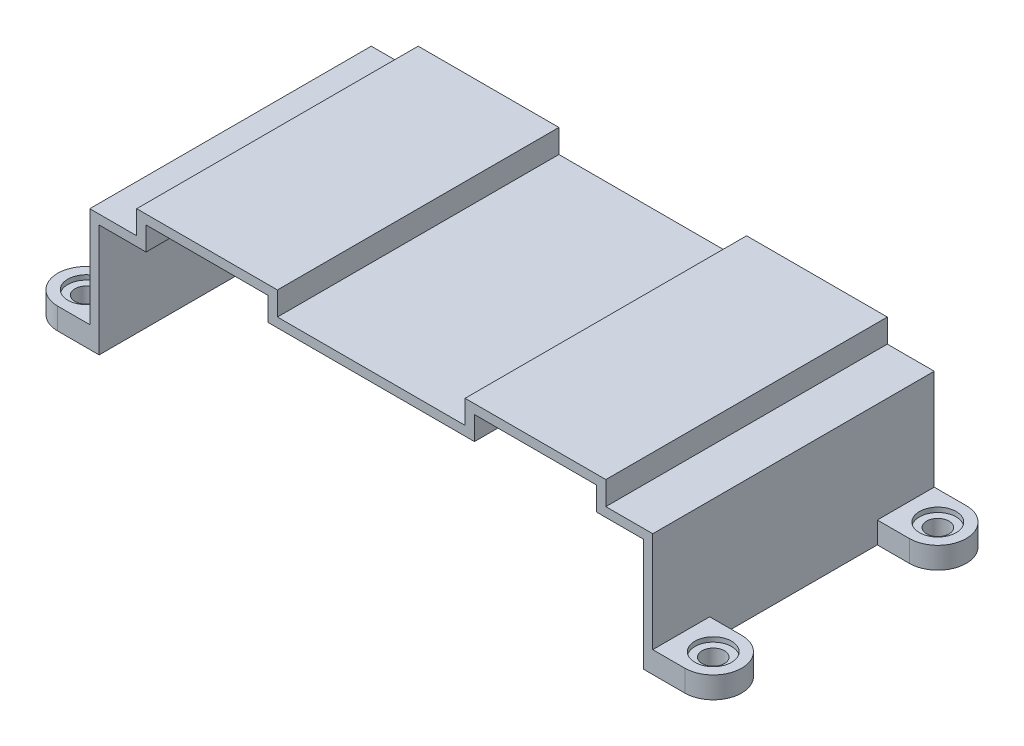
ISO-10303-21;
HEADER;
FILE_DESCRIPTION(('STEP AP214'),'2;1');
FILE_NAME('part.step','',(''),(''),'','','');
FILE_SCHEMA(('AUTOMOTIVE_DESIGN { 1 0 10303 214 1 1 1 1 }'));
ENDSEC;
DATA;
#1=APPLICATION_CONTEXT('core data for automotive mechanical design processes');
#2=APPLICATION_PROTOCOL_DEFINITION('international standard','automotive_design',2000,#1);
#3=PRODUCT_CONTEXT('',#1,'mechanical');
#4=PRODUCT('Part','Part','',(#3));
#5=PRODUCT_RELATED_PRODUCT_CATEGORY('part','',(#4));
#6=PRODUCT_DEFINITION_FORMATION('','',#4);
#7=PRODUCT_DEFINITION_CONTEXT('part definition',#1,'design');
#8=PRODUCT_DEFINITION('design','',#6,#7);
#9=PRODUCT_DEFINITION_SHAPE('','',#8);
#10=(LENGTH_UNIT() NAMED_UNIT(*) SI_UNIT(.MILLI.,.METRE.));
#11=(NAMED_UNIT(*) PLANE_ANGLE_UNIT() SI_UNIT($,.RADIAN.));
#12=(NAMED_UNIT(*) SI_UNIT($,.STERADIAN.) SOLID_ANGLE_UNIT());
#13=UNCERTAINTY_MEASURE_WITH_UNIT(LENGTH_MEASURE(1.E-05),#10,'distance_accuracy_value','');
#14=(GEOMETRIC_REPRESENTATION_CONTEXT(3) GLOBAL_UNCERTAINTY_ASSIGNED_CONTEXT((#13)) GLOBAL_UNIT_ASSIGNED_CONTEXT((#10,
#11,#12)) REPRESENTATION_CONTEXT('',''));
#15=CARTESIAN_POINT('',(0.,0.,0.));
#16=DIRECTION('',(0.,0.,1.));
#17=DIRECTION('',(1.,0.,0.));
#18=AXIS2_PLACEMENT_3D('',#15,#16,#17);
#19=CARTESIAN_POINT('',(-84.8733534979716,5.84200000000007,7.70474442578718));
#20=DIRECTION('',(0.,1.,0.));
#21=DIRECTION('',(-1.,0.,0.));
#22=AXIS2_PLACEMENT_3D('',#19,#20,#21);
#23=PLANE('',#22);
#24=DIRECTION('',(0.,0.,-1.));
#25=VECTOR('',#24,1.);
#26=CARTESIAN_POINT('',(-76.2,5.84200000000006,0.));
#27=LINE('',#26,#25);
#28=CARTESIAN_POINT('',(-76.2,5.84200000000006,15.4094888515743));
#29=VERTEX_POINT('',#28);
#30=CARTESIAN_POINT('',(-76.2,5.84200000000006,0.));
#31=VERTEX_POINT('',#30);
#32=EDGE_CURVE('E319',#29,#31,#27,.T.);
#33=ORIENTED_EDGE('',*,*,#32,.T.);
#34=DIRECTION('',(-1.,0.,0.));
#35=VECTOR('',#34,1.);
#36=CARTESIAN_POINT('',(-76.2,5.84200000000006,0.));
#37=LINE('',#36,#35);
#38=CARTESIAN_POINT('',(-84.8733534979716,5.84200000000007,0.));
#39=VERTEX_POINT('',#38);
#40=EDGE_CURVE('E328',#31,#39,#37,.T.);
#41=ORIENTED_EDGE('',*,*,#40,.T.);
#42=CARTESIAN_POINT('',(-84.8733534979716,5.84200000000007,7.70474442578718));
#43=DIRECTION('',(0.,1.,0.));
#44=DIRECTION('',(-1.,0.,0.));
#45=AXIS2_PLACEMENT_3D('',#42,#43,#44);
#46=CIRCLE('',#45,7.70474442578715);
#47=CARTESIAN_POINT('',(-84.8733534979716,5.84200000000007,15.4094888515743));
#48=VERTEX_POINT('',#47);
#49=EDGE_CURVE('E326',#39,#48,#46,.T.);
#50=ORIENTED_EDGE('',*,*,#49,.T.);
#51=DIRECTION('',(1.,0.,0.));
#52=VECTOR('',#51,1.);
#53=CARTESIAN_POINT('',(-76.2,5.84200000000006,15.4094888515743));
#54=LINE('',#53,#52);
#55=EDGE_CURVE('E322',#48,#29,#54,.T.);
#56=ORIENTED_EDGE('',*,*,#55,.T.);
#57=EDGE_LOOP('',(#33,#41,#50,#56));
#58=FACE_BOUND('',#57,.T.);
#59=CARTESIAN_POINT('',(-84.8733534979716,5.84200000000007,7.70474442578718));
#60=DIRECTION('',(0.,-1.,0.));
#61=DIRECTION('',(-1.,0.,0.));
#62=AXIS2_PLACEMENT_3D('',#59,#60,#61);
#63=CIRCLE('',#62,4.96717548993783);
#64=CARTESIAN_POINT('',(-89.8405289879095,5.84200000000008,7.70474442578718));
#65=VERTEX_POINT('',#64);
#66=EDGE_CURVE('E312',#65,#65,#63,.T.);
#67=ORIENTED_EDGE('',*,*,#66,.T.);
#68=EDGE_LOOP('',(#67));
#69=FACE_BOUND('',#68,.T.);
#70=ADVANCED_FACE('F31',(#58,#69),#23,.T.);
#71=CARTESIAN_POINT('',(-76.2,33.02,76.2));
#72=DIRECTION('',(1.,0.,0.));
#73=DIRECTION('',(0.,1.,0.));
#74=AXIS2_PLACEMENT_3D('',#71,#72,#73);
#75=PLANE('',#74);
#76=DIRECTION('',(0.,-1.,0.));
#77=VECTOR('',#76,1.);
#78=CARTESIAN_POINT('',(-76.2,5.84200000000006,15.4094888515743));
#79=LINE('',#78,#77);
#80=CARTESIAN_POINT('',(-76.2,0.,15.4094888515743));
#81=VERTEX_POINT('',#80);
#82=EDGE_CURVE('E330',#29,#81,#79,.T.);
#83=ORIENTED_EDGE('',*,*,#82,.T.);
#84=DIRECTION('',(0.,0.,-1.));
#85=VECTOR('',#84,1.);
#86=CARTESIAN_POINT('',(-76.2,0.,76.2));
#87=LINE('',#86,#85);
#88=CARTESIAN_POINT('',(-76.2,0.,60.7905111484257));
#89=VERTEX_POINT('',#88);
#90=EDGE_CURVE('E501',#89,#81,#87,.T.);
#91=ORIENTED_EDGE('',*,*,#90,.F.);
#92=DIRECTION('',(0.,-1.,0.));
#93=VECTOR('',#92,1.);
#94=CARTESIAN_POINT('',(-76.2,5.84200000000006,60.7905111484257));
#95=LINE('',#94,#93);
#96=CARTESIAN_POINT('',(-76.2,5.84200000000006,60.7905111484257));
#97=VERTEX_POINT('',#96);
#98=EDGE_CURVE('E415',#97,#89,#95,.T.);
#99=ORIENTED_EDGE('',*,*,#98,.F.);
#100=DIRECTION('',(0.,0.,1.));
#101=VECTOR('',#100,1.);
#102=CARTESIAN_POINT('',(-76.2,5.84200000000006,76.2));
#103=LINE('',#102,#101);
#104=CARTESIAN_POINT('',(-76.2,5.84200000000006,76.2));
#105=VERTEX_POINT('',#104);
#106=EDGE_CURVE('E516',#97,#105,#103,.T.);
#107=ORIENTED_EDGE('',*,*,#106,.T.);
#108=DIRECTION('',(0.,-1.,0.));
#109=VECTOR('',#108,1.);
#110=CARTESIAN_POINT('',(-76.2,33.02,76.2));
#111=LINE('',#110,#109);
#112=CARTESIAN_POINT('',(-76.2,33.02,76.2));
#113=VERTEX_POINT('',#112);
#114=EDGE_CURVE('E510',#113,#105,#111,.T.);
#115=ORIENTED_EDGE('',*,*,#114,.F.);
#116=DIRECTION('',(0.,0.,-1.));
#117=VECTOR('',#116,1.);
#118=CARTESIAN_POINT('',(-76.2,33.02,76.2));
#119=LINE('',#118,#117);
#120=CARTESIAN_POINT('',(-76.2,33.02,0.));
#121=VERTEX_POINT('',#120);
#122=EDGE_CURVE('E504',#113,#121,#119,.T.);
#123=ORIENTED_EDGE('',*,*,#122,.T.);
#124=DIRECTION('',(0.,-1.,0.));
#125=VECTOR('',#124,1.);
#126=CARTESIAN_POINT('',(-76.2,33.02,0.));
#127=LINE('',#126,#125);
#128=EDGE_CURVE('E427',#121,#31,#127,.T.);
#129=ORIENTED_EDGE('',*,*,#128,.T.);
#130=ORIENTED_EDGE('',*,*,#32,.F.);
#131=EDGE_LOOP('',(#83,#91,#99,#107,#115,#123,#129,#130));
#132=FACE_BOUND('',#131,.T.);
#133=ADVANCED_FACE('F642',(#132),#75,.F.);
#134=CARTESIAN_POINT('',(84.8733534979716,5.84200000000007,68.4952555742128));
#135=DIRECTION('',(0.,1.,0.));
#136=DIRECTION('',(1.,0.,0.));
#137=AXIS2_PLACEMENT_3D('',#134,#135,#136);
#138=PLANE('',#137);
#139=DIRECTION('',(0.,0.,1.));
#140=VECTOR('',#139,1.);
#141=CARTESIAN_POINT('',(76.2,5.84200000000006,76.2));
#142=LINE('',#141,#140);
#143=CARTESIAN_POINT('',(76.2,5.84200000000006,60.7905111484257));
#144=VERTEX_POINT('',#143);
#145=CARTESIAN_POINT('',(76.2,5.84200000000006,76.2));
#146=VERTEX_POINT('',#145);
#147=EDGE_CURVE('E357',#144,#146,#142,.T.);
#148=ORIENTED_EDGE('',*,*,#147,.T.);
#149=DIRECTION('',(1.,0.,0.));
#150=VECTOR('',#149,1.);
#151=CARTESIAN_POINT('',(76.2,5.84200000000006,76.2));
#152=LINE('',#151,#150);
#153=CARTESIAN_POINT('',(84.8733534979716,5.84200000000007,76.2));
#154=VERTEX_POINT('',#153);
#155=EDGE_CURVE('E359',#146,#154,#152,.T.);
#156=ORIENTED_EDGE('',*,*,#155,.T.);
#157=CARTESIAN_POINT('',(84.8733534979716,5.84200000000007,68.4952555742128));
#158=DIRECTION('',(0.,1.,0.));
#159=DIRECTION('',(1.,0.,0.));
#160=AXIS2_PLACEMENT_3D('',#157,#158,#159);
#161=CIRCLE('',#160,7.70474442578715);
#162=CARTESIAN_POINT('',(84.8733534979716,5.84200000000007,60.7905111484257));
#163=VERTEX_POINT('',#162);
#164=EDGE_CURVE('E356',#154,#163,#161,.T.);
#165=ORIENTED_EDGE('',*,*,#164,.T.);
#166=DIRECTION('',(-1.,0.,0.));
#167=VECTOR('',#166,1.);
#168=CARTESIAN_POINT('',(76.2,5.84200000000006,60.7905111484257));
#169=LINE('',#168,#167);
#170=EDGE_CURVE('E354',#163,#144,#169,.T.);
#171=ORIENTED_EDGE('',*,*,#170,.T.);
#172=EDGE_LOOP('',(#148,#156,#165,#171));
#173=FACE_BOUND('',#172,.T.);
#174=CARTESIAN_POINT('',(84.8733534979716,5.84200000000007,68.4952555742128));
#175=DIRECTION('',(0.,-1.,0.));
#176=DIRECTION('',(1.,0.,0.));
#177=AXIS2_PLACEMENT_3D('',#174,#175,#176);
#178=CIRCLE('',#177,4.96717548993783);
#179=CARTESIAN_POINT('',(89.8405289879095,5.84200000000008,68.4952555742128));
#180=VERTEX_POINT('',#179);
#181=EDGE_CURVE('E347',#180,#180,#178,.T.);
#182=ORIENTED_EDGE('',*,*,#181,.T.);
#183=EDGE_LOOP('',(#182));
#184=FACE_BOUND('',#183,.T.);
#185=ADVANCED_FACE('F387',(#173,#184),#138,.T.);
#186=CARTESIAN_POINT('',(76.2,33.02,76.2));
#187=DIRECTION('',(-1.,0.,0.));
#188=DIRECTION('',(0.,-1.,0.));
#189=AXIS2_PLACEMENT_3D('',#186,#187,#188);
#190=PLANE('',#189);
#191=DIRECTION('',(0.,0.,-1.));
#192=VECTOR('',#191,1.);
#193=CARTESIAN_POINT('',(76.2,0.,76.2));
#194=LINE('',#193,#192);
#195=CARTESIAN_POINT('',(76.2,0.,60.7905111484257));
#196=VERTEX_POINT('',#195);
#197=CARTESIAN_POINT('',(76.2,0.,15.4094888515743));
#198=VERTEX_POINT('',#197);
#199=EDGE_CURVE('E53',#196,#198,#194,.T.);
#200=ORIENTED_EDGE('',*,*,#199,.T.);
#201=DIRECTION('',(0.,-1.,0.));
#202=VECTOR('',#201,1.);
#203=CARTESIAN_POINT('',(76.2,5.84200000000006,15.4094888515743));
#204=LINE('',#203,#202);
#205=CARTESIAN_POINT('',(76.2,5.84200000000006,15.4094888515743));
#206=VERTEX_POINT('',#205);
#207=EDGE_CURVE('E48',#206,#198,#204,.T.);
#208=ORIENTED_EDGE('',*,*,#207,.F.);
#209=DIRECTION('',(0.,0.,-1.));
#210=VECTOR('',#209,1.);
#211=CARTESIAN_POINT('',(76.2,5.84200000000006,0.));
#212=LINE('',#211,#210);
#213=CARTESIAN_POINT('',(76.2,5.84200000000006,0.));
#214=VERTEX_POINT('',#213);
#215=EDGE_CURVE('E278',#206,#214,#212,.T.);
#216=ORIENTED_EDGE('',*,*,#215,.T.);
#217=DIRECTION('',(0.,1.,0.));
#218=VECTOR('',#217,1.);
#219=CARTESIAN_POINT('',(76.2,33.02,0.));
#220=LINE('',#219,#218);
#221=CARTESIAN_POINT('',(76.2,33.02,0.));
#222=VERTEX_POINT('',#221);
#223=EDGE_CURVE('E266',#214,#222,#220,.T.);
#224=ORIENTED_EDGE('',*,*,#223,.T.);
#225=DIRECTION('',(0.,0.,-1.));
#226=VECTOR('',#225,1.);
#227=CARTESIAN_POINT('',(76.2,33.02,76.2));
#228=LINE('',#227,#226);
#229=CARTESIAN_POINT('',(76.2,33.02,76.2));
#230=VERTEX_POINT('',#229);
#231=EDGE_CURVE('E393',#230,#222,#228,.T.);
#232=ORIENTED_EDGE('',*,*,#231,.F.);
#233=DIRECTION('',(0.,1.,0.));
#234=VECTOR('',#233,1.);
#235=CARTESIAN_POINT('',(76.2,33.02,76.2));
#236=LINE('',#235,#234);
#237=EDGE_CURVE('E392',#146,#230,#236,.T.);
#238=ORIENTED_EDGE('',*,*,#237,.F.);
#239=ORIENTED_EDGE('',*,*,#147,.F.);
#240=DIRECTION('',(0.,-1.,0.));
#241=VECTOR('',#240,1.);
#242=CARTESIAN_POINT('',(76.2,5.84200000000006,60.7905111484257));
#243=LINE('',#242,#241);
#244=EDGE_CURVE('E369',#144,#196,#243,.T.);
#245=ORIENTED_EDGE('',*,*,#244,.T.);
#246=EDGE_LOOP('',(#200,#208,#216,#224,#232,#238,#239,#245));
#247=FACE_BOUND('',#246,.T.);
#248=ADVANCED_FACE('F279',(#247),#190,.F.);
#249=CARTESIAN_POINT('',(25.4,39.37,76.2));
#250=DIRECTION('',(0.,-1.,0.));
#251=DIRECTION('',(0.,0.,-1.));
#252=AXIS2_PLACEMENT_3D('',#249,#250,#251);
#253=PLANE('',#252);
#254=DIRECTION('',(-1.,0.,0.));
#255=VECTOR('',#254,1.);
#256=CARTESIAN_POINT('',(25.4,39.37,0.));
#257=LINE('',#256,#255);
#258=CARTESIAN_POINT('',(63.5,39.37,0.));
#259=VERTEX_POINT('',#258);
#260=CARTESIAN_POINT('',(25.4,39.37,0.));
#261=VERTEX_POINT('',#260);
#262=EDGE_CURVE('E411',#259,#261,#257,.T.);
#263=ORIENTED_EDGE('',*,*,#262,.T.);
#264=DIRECTION('',(0.,0.,-1.));
#265=VECTOR('',#264,1.);
#266=CARTESIAN_POINT('',(25.4,39.37,76.2));
#267=LINE('',#266,#265);
#268=CARTESIAN_POINT('',(25.4,39.37,76.2));
#269=VERTEX_POINT('',#268);
#270=EDGE_CURVE('E11',#269,#261,#267,.T.);
#271=ORIENTED_EDGE('',*,*,#270,.F.);
#272=DIRECTION('',(-1.,0.,0.));
#273=VECTOR('',#272,1.);
#274=CARTESIAN_POINT('',(25.4,39.37,76.2));
#275=LINE('',#274,#273);
#276=CARTESIAN_POINT('',(63.5,39.37,76.2));
#277=VERTEX_POINT('',#276);
#278=EDGE_CURVE('E457',#277,#269,#275,.T.);
#279=ORIENTED_EDGE('',*,*,#278,.F.);
#280=DIRECTION('',(0.,0.,-1.));
#281=VECTOR('',#280,1.);
#282=CARTESIAN_POINT('',(63.5,39.37,76.2));
#283=LINE('',#282,#281);
#284=EDGE_CURVE('E410',#277,#259,#283,.T.);
#285=ORIENTED_EDGE('',*,*,#284,.T.);
#286=EDGE_LOOP('',(#263,#271,#279,#285));
#287=FACE_BOUND('',#286,.T.);
#288=ADVANCED_FACE('F33',(#287),#253,.F.);
#289=CARTESIAN_POINT('',(25.4,33.02,76.2));
#290=DIRECTION('',(1.,0.,0.));
#291=DIRECTION('',(0.,0.,-1.));
#292=AXIS2_PLACEMENT_3D('',#289,#290,#291);
#293=PLANE('',#292);
#294=DIRECTION('',(0.,-1.,0.));
#295=VECTOR('',#294,1.);
#296=CARTESIAN_POINT('',(25.4,33.02,0.));
#297=LINE('',#296,#295);
#298=CARTESIAN_POINT('',(25.4,33.02,0.));
#299=VERTEX_POINT('',#298);
#300=EDGE_CURVE('E414',#261,#299,#297,.T.);
#301=ORIENTED_EDGE('',*,*,#300,.T.);
#302=DIRECTION('',(0.,0.,-1.));
#303=VECTOR('',#302,1.);
#304=CARTESIAN_POINT('',(25.4,33.02,76.2));
#305=LINE('',#304,#303);
#306=CARTESIAN_POINT('',(25.4,33.02,76.2));
#307=VERTEX_POINT('',#306);
#308=EDGE_CURVE('E40',#307,#299,#305,.T.);
#309=ORIENTED_EDGE('',*,*,#308,.F.);
#310=DIRECTION('',(0.,-1.,0.));
#311=VECTOR('',#310,1.);
#312=CARTESIAN_POINT('',(25.4,33.02,76.2));
#313=LINE('',#312,#311);
#314=EDGE_CURVE('E687',#269,#307,#313,.T.);
#315=ORIENTED_EDGE('',*,*,#314,.F.);
#316=ORIENTED_EDGE('',*,*,#270,.T.);
#317=EDGE_LOOP('',(#301,#309,#315,#316));
#318=FACE_BOUND('',#317,.T.);
#319=ADVANCED_FACE('F1179',(#318),#293,.F.);
#320=CARTESIAN_POINT('',(-25.4,33.02,76.2));
#321=DIRECTION('',(0.,-1.,0.));
#322=DIRECTION('',(1.,0.,0.));
#323=AXIS2_PLACEMENT_3D('',#320,#321,#322);
#324=PLANE('',#323);
#325=DIRECTION('',(-1.,0.,0.));
#326=VECTOR('',#325,1.);
#327=CARTESIAN_POINT('',(-25.4,33.02,0.));
#328=LINE('',#327,#326);
#329=CARTESIAN_POINT('',(-25.4,33.02,0.));
#330=VERTEX_POINT('',#329);
#331=EDGE_CURVE('E417',#299,#330,#328,.T.);
#332=ORIENTED_EDGE('',*,*,#331,.T.);
#333=DIRECTION('',(0.,0.,-1.));
#334=VECTOR('',#333,1.);
#335=CARTESIAN_POINT('',(-25.4,33.02,76.2));
#336=LINE('',#335,#334);
#337=CARTESIAN_POINT('',(-25.4,33.02,76.2));
#338=VERTEX_POINT('',#337);
#339=EDGE_CURVE('E658',#338,#330,#336,.T.);
#340=ORIENTED_EDGE('',*,*,#339,.F.);
#341=DIRECTION('',(-1.,0.,0.));
#342=VECTOR('',#341,1.);
#343=CARTESIAN_POINT('',(-25.4,33.02,76.2));
#344=LINE('',#343,#342);
#345=EDGE_CURVE('E667',#307,#338,#344,.T.);
#346=ORIENTED_EDGE('',*,*,#345,.F.);
#347=ORIENTED_EDGE('',*,*,#308,.T.);
#348=EDGE_LOOP('',(#332,#340,#346,#347));
#349=FACE_BOUND('',#348,.T.);
#350=ADVANCED_FACE('F665',(#349),#324,.F.);
#351=CARTESIAN_POINT('',(-25.4,33.02,76.2));
#352=DIRECTION('',(-1.,0.,0.));
#353=DIRECTION('',(0.,0.,1.));
#354=AXIS2_PLACEMENT_3D('',#351,#352,#353);
#355=PLANE('',#354);
#356=DIRECTION('',(0.,1.,0.));
#357=VECTOR('',#356,1.);
#358=CARTESIAN_POINT('',(-25.4,33.02,0.));
#359=LINE('',#358,#357);
#360=CARTESIAN_POINT('',(-25.4,39.37,0.));
#361=VERTEX_POINT('',#360);
#362=EDGE_CURVE('E419',#330,#361,#359,.T.);
#363=ORIENTED_EDGE('',*,*,#362,.T.);
#364=DIRECTION('',(0.,0.,-1.));
#365=VECTOR('',#364,1.);
#366=CARTESIAN_POINT('',(-25.4,39.37,76.2));
#367=LINE('',#366,#365);
#368=CARTESIAN_POINT('',(-25.4,39.37,76.2));
#369=VERTEX_POINT('',#368);
#370=EDGE_CURVE('E653',#369,#361,#367,.T.);
#371=ORIENTED_EDGE('',*,*,#370,.F.);
#372=DIRECTION('',(0.,1.,0.));
#373=VECTOR('',#372,1.);
#374=CARTESIAN_POINT('',(-25.4,33.02,76.2));
#375=LINE('',#374,#373);
#376=EDGE_CURVE('E682',#338,#369,#375,.T.);
#377=ORIENTED_EDGE('',*,*,#376,.F.);
#378=ORIENTED_EDGE('',*,*,#339,.T.);
#379=EDGE_LOOP('',(#363,#371,#377,#378));
#380=FACE_BOUND('',#379,.T.);
#381=ADVANCED_FACE('F673',(#380),#355,.F.);
#382=CARTESIAN_POINT('',(-63.5,39.37,76.2));
#383=DIRECTION('',(0.,-1.,0.));
#384=DIRECTION('',(1.,0.,0.));
#385=AXIS2_PLACEMENT_3D('',#382,#383,#384);
#386=PLANE('',#385);
#387=DIRECTION('',(-1.,0.,0.));
#388=VECTOR('',#387,1.);
#389=CARTESIAN_POINT('',(-63.5,39.37,0.));
#390=LINE('',#389,#388);
#391=CARTESIAN_POINT('',(-63.5,39.37,0.));
#392=VERTEX_POINT('',#391);
#393=EDGE_CURVE('E421',#361,#392,#390,.T.);
#394=ORIENTED_EDGE('',*,*,#393,.T.);
#395=DIRECTION('',(0.,0.,-1.));
#396=VECTOR('',#395,1.);
#397=CARTESIAN_POINT('',(-63.5,39.37,76.2));
#398=LINE('',#397,#396);
#399=CARTESIAN_POINT('',(-63.5,39.37,76.2));
#400=VERTEX_POINT('',#399);
#401=EDGE_CURVE('E650',#400,#392,#398,.T.);
#402=ORIENTED_EDGE('',*,*,#401,.F.);
#403=DIRECTION('',(-1.,0.,0.));
#404=VECTOR('',#403,1.);
#405=CARTESIAN_POINT('',(-63.5,39.37,76.2));
#406=LINE('',#405,#404);
#407=EDGE_CURVE('E679',#369,#400,#406,.T.);
#408=ORIENTED_EDGE('',*,*,#407,.F.);
#409=ORIENTED_EDGE('',*,*,#370,.T.);
#410=EDGE_LOOP('',(#394,#402,#408,#409));
#411=FACE_BOUND('',#410,.T.);
#412=ADVANCED_FACE('F677',(#411),#386,.F.);
#413=CARTESIAN_POINT('',(-63.5,39.37,76.2));
#414=DIRECTION('',(1.,0.,0.));
#415=DIRECTION('',(0.,0.,-1.));
#416=AXIS2_PLACEMENT_3D('',#413,#414,#415);
#417=PLANE('',#416);
#418=DIRECTION('',(0.,-1.,0.));
#419=VECTOR('',#418,1.);
#420=CARTESIAN_POINT('',(-63.5,39.37,0.));
#421=LINE('',#420,#419);
#422=CARTESIAN_POINT('',(-63.5,33.02,0.));
#423=VERTEX_POINT('',#422);
#424=EDGE_CURVE('E423',#392,#423,#421,.T.);
#425=ORIENTED_EDGE('',*,*,#424,.T.);
#426=DIRECTION('',(0.,0.,-1.));
#427=VECTOR('',#426,1.);
#428=CARTESIAN_POINT('',(-63.5,33.02,76.2));
#429=LINE('',#428,#427);
#430=CARTESIAN_POINT('',(-63.5,33.02,76.2));
#431=VERTEX_POINT('',#430);
#432=EDGE_CURVE('E648',#431,#423,#429,.T.);
#433=ORIENTED_EDGE('',*,*,#432,.F.);
#434=DIRECTION('',(0.,-1.,0.));
#435=VECTOR('',#434,1.);
#436=CARTESIAN_POINT('',(-63.5,39.37,76.2));
#437=LINE('',#436,#435);
#438=EDGE_CURVE('E681',#400,#431,#437,.T.);
#439=ORIENTED_EDGE('',*,*,#438,.F.);
#440=ORIENTED_EDGE('',*,*,#401,.T.);
#441=EDGE_LOOP('',(#425,#433,#439,#440));
#442=FACE_BOUND('',#441,.T.);
#443=ADVANCED_FACE('F755',(#442),#417,.F.);
#444=CARTESIAN_POINT('',(-76.2,33.02,76.2));
#445=DIRECTION('',(0.,-1.,0.));
#446=DIRECTION('',(0.,0.,-1.));
#447=AXIS2_PLACEMENT_3D('',#444,#445,#446);
#448=PLANE('',#447);
#449=DIRECTION('',(-1.,0.,0.));
#450=VECTOR('',#449,1.);
#451=CARTESIAN_POINT('',(-76.2,33.02,0.));
#452=LINE('',#451,#450);
#453=EDGE_CURVE('E425',#423,#121,#452,.T.);
#454=ORIENTED_EDGE('',*,*,#453,.T.);
#455=ORIENTED_EDGE('',*,*,#122,.F.);
#456=DIRECTION('',(-1.,0.,0.));
#457=VECTOR('',#456,1.);
#458=CARTESIAN_POINT('',(-76.2,33.02,76.2));
#459=LINE('',#458,#457);
#460=EDGE_CURVE('E515',#431,#113,#459,.T.);
#461=ORIENTED_EDGE('',*,*,#460,.F.);
#462=ORIENTED_EDGE('',*,*,#432,.T.);
#463=EDGE_LOOP('',(#454,#455,#461,#462));
#464=FACE_BOUND('',#463,.T.);
#465=ADVANCED_FACE('F753',(#464),#448,.F.);
#466=CARTESIAN_POINT('',(-76.2,0.,76.2));
#467=DIRECTION('',(0.,1.,0.));
#468=DIRECTION('',(-1.,0.,0.));
#469=AXIS2_PLACEMENT_3D('',#466,#467,#468);
#470=PLANE('',#469);
#471=CARTESIAN_POINT('',(-84.8733534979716,0.,7.70474442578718));
#472=DIRECTION('',(0.,1.,0.));
#473=DIRECTION('',(-1.,0.,0.));
#474=AXIS2_PLACEMENT_3D('',#471,#472,#473);
#475=CIRCLE('',#474,3.02259999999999);
#476=CARTESIAN_POINT('',(-87.8959534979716,0.,7.70474442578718));
#477=VERTEX_POINT('',#476);
#478=EDGE_CURVE('E309',#477,#477,#475,.T.);
#479=ORIENTED_EDGE('',*,*,#478,.T.);
#480=EDGE_LOOP('',(#479));
#481=FACE_BOUND('',#480,.T.);
#482=CARTESIAN_POINT('',(-84.8733534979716,0.,68.4952555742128));
#483=DIRECTION('',(0.,1.,0.));
#484=DIRECTION('',(-1.,0.,0.));
#485=AXIS2_PLACEMENT_3D('',#482,#483,#484);
#486=CIRCLE('',#485,3.02259999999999);
#487=CARTESIAN_POINT('',(-87.8959534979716,0.,68.4952555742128));
#488=VERTEX_POINT('',#487);
#489=EDGE_CURVE('E709',#488,#488,#486,.T.);
#490=ORIENTED_EDGE('',*,*,#489,.T.);
#491=EDGE_LOOP('',(#490));
#492=FACE_BOUND('',#491,.T.);
#493=DIRECTION('',(1.,0.,0.));
#494=VECTOR('',#493,1.);
#495=CARTESIAN_POINT('',(-76.2,0.,0.));
#496=LINE('',#495,#494);
#497=CARTESIAN_POINT('',(-84.8733534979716,0.,0.));
#498=VERTEX_POINT('',#497);
#499=CARTESIAN_POINT('',(-73.66,0.,0.));
#500=VERTEX_POINT('',#499);
#501=EDGE_CURVE('E429',#498,#500,#496,.T.);
#502=ORIENTED_EDGE('',*,*,#501,.T.);
#503=DIRECTION('',(0.,0.,-1.));
#504=VECTOR('',#503,1.);
#505=CARTESIAN_POINT('',(-73.66,0.,76.2));
#506=LINE('',#505,#504);
#507=CARTESIAN_POINT('',(-73.66,0.,76.2));
#508=VERTEX_POINT('',#507);
#509=EDGE_CURVE('E498',#508,#500,#506,.T.);
#510=ORIENTED_EDGE('',*,*,#509,.F.);
#511=DIRECTION('',(1.,0.,0.));
#512=VECTOR('',#511,1.);
#513=CARTESIAN_POINT('',(-76.2,0.,76.2));
#514=LINE('',#513,#512);
#515=CARTESIAN_POINT('',(-84.8733534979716,0.,76.2));
#516=VERTEX_POINT('',#515);
#517=EDGE_CURVE('E514',#516,#508,#514,.T.);
#518=ORIENTED_EDGE('',*,*,#517,.F.);
#519=CARTESIAN_POINT('',(-84.8733534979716,0.,68.4952555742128));
#520=DIRECTION('',(0.,-1.,0.));
#521=DIRECTION('',(-1.,0.,0.));
#522=AXIS2_PLACEMENT_3D('',#519,#520,#521);
#523=CIRCLE('',#522,7.70474442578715);
#524=CARTESIAN_POINT('',(-84.8733534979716,0.,60.7905111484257));
#525=VERTEX_POINT('',#524);
#526=EDGE_CURVE('E695',#516,#525,#523,.T.);
#527=ORIENTED_EDGE('',*,*,#526,.T.);
#528=DIRECTION('',(1.,0.,0.));
#529=VECTOR('',#528,1.);
#530=CARTESIAN_POINT('',(-76.2,0.,60.7905111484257));
#531=LINE('',#530,#529);
#532=EDGE_CURVE('E697',#525,#89,#531,.T.);
#533=ORIENTED_EDGE('',*,*,#532,.T.);
#534=ORIENTED_EDGE('',*,*,#90,.T.);
#535=DIRECTION('',(1.,0.,0.));
#536=VECTOR('',#535,1.);
#537=CARTESIAN_POINT('',(-76.2,0.,15.4094888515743));
#538=LINE('',#537,#536);
#539=CARTESIAN_POINT('',(-84.8733534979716,0.,15.4094888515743));
#540=VERTEX_POINT('',#539);
#541=EDGE_CURVE('E316',#540,#81,#538,.T.);
#542=ORIENTED_EDGE('',*,*,#541,.F.);
#543=CARTESIAN_POINT('',(-84.8733534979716,0.,7.70474442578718));
#544=DIRECTION('',(0.,1.,0.));
#545=DIRECTION('',(-1.,0.,0.));
#546=AXIS2_PLACEMENT_3D('',#543,#544,#545);
#547=CIRCLE('',#546,7.70474442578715);
#548=EDGE_CURVE('E323',#498,#540,#547,.T.);
#549=ORIENTED_EDGE('',*,*,#548,.F.);
#550=EDGE_LOOP('',(#502,#510,#518,#527,#533,#534,#542,#549));
#551=FACE_BOUND('',#550,.T.);
#552=ADVANCED_FACE('F621',(#481,#492,#551),#470,.F.);
#553=CARTESIAN_POINT('',(-73.66,30.48,76.2));
#554=DIRECTION('',(-1.,0.,0.));
#555=DIRECTION('',(0.,0.,1.));
#556=AXIS2_PLACEMENT_3D('',#553,#554,#555);
#557=PLANE('',#556);
#558=DIRECTION('',(0.,1.,0.));
#559=VECTOR('',#558,1.);
#560=CARTESIAN_POINT('',(-73.66,30.48,0.));
#561=LINE('',#560,#559);
#562=CARTESIAN_POINT('',(-73.66,30.48,0.));
#563=VERTEX_POINT('',#562);
#564=EDGE_CURVE('E431',#500,#563,#561,.T.);
#565=ORIENTED_EDGE('',*,*,#564,.T.);
#566=DIRECTION('',(0.,0.,-1.));
#567=VECTOR('',#566,1.);
#568=CARTESIAN_POINT('',(-73.66,30.48,76.2));
#569=LINE('',#568,#567);
#570=CARTESIAN_POINT('',(-73.66,30.48,76.2));
#571=VERTEX_POINT('',#570);
#572=EDGE_CURVE('E495',#571,#563,#569,.T.);
#573=ORIENTED_EDGE('',*,*,#572,.F.);
#574=DIRECTION('',(0.,1.,0.));
#575=VECTOR('',#574,1.);
#576=CARTESIAN_POINT('',(-73.66,30.48,76.2));
#577=LINE('',#576,#575);
#578=EDGE_CURVE('E524',#508,#571,#577,.T.);
#579=ORIENTED_EDGE('',*,*,#578,.F.);
#580=ORIENTED_EDGE('',*,*,#509,.T.);
#581=EDGE_LOOP('',(#565,#573,#579,#580));
#582=FACE_BOUND('',#581,.T.);
#583=ADVANCED_FACE('F617',(#582),#557,.F.);
#584=CARTESIAN_POINT('',(-73.66,30.48,76.2));
#585=DIRECTION('',(0.,1.,0.));
#586=DIRECTION('',(0.,0.,1.));
#587=AXIS2_PLACEMENT_3D('',#584,#585,#586);
#588=PLANE('',#587);
#589=DIRECTION('',(1.,0.,0.));
#590=VECTOR('',#589,1.);
#591=CARTESIAN_POINT('',(-73.66,30.48,0.));
#592=LINE('',#591,#590);
#593=CARTESIAN_POINT('',(-60.96,30.48,0.));
#594=VERTEX_POINT('',#593);
#595=EDGE_CURVE('E433',#563,#594,#592,.T.);
#596=ORIENTED_EDGE('',*,*,#595,.T.);
#597=DIRECTION('',(0.,0.,-1.));
#598=VECTOR('',#597,1.);
#599=CARTESIAN_POINT('',(-60.96,30.48,76.2));
#600=LINE('',#599,#598);
#601=CARTESIAN_POINT('',(-60.96,30.48,76.2));
#602=VERTEX_POINT('',#601);
#603=EDGE_CURVE('E492',#602,#594,#600,.T.);
#604=ORIENTED_EDGE('',*,*,#603,.F.);
#605=DIRECTION('',(1.,0.,0.));
#606=VECTOR('',#605,1.);
#607=CARTESIAN_POINT('',(-73.66,30.48,76.2));
#608=LINE('',#607,#606);
#609=EDGE_CURVE('E526',#571,#602,#608,.T.);
#610=ORIENTED_EDGE('',*,*,#609,.F.);
#611=ORIENTED_EDGE('',*,*,#572,.T.);
#612=EDGE_LOOP('',(#596,#604,#610,#611));
#613=FACE_BOUND('',#612,.T.);
#614=ADVANCED_FACE('F612',(#613),#588,.F.);
#615=CARTESIAN_POINT('',(-60.96,36.83,76.2));
#616=DIRECTION('',(-1.,0.,0.));
#617=DIRECTION('',(0.,0.,1.));
#618=AXIS2_PLACEMENT_3D('',#615,#616,#617);
#619=PLANE('',#618);
#620=DIRECTION('',(0.,1.,0.));
#621=VECTOR('',#620,1.);
#622=CARTESIAN_POINT('',(-60.96,36.83,0.));
#623=LINE('',#622,#621);
#624=CARTESIAN_POINT('',(-60.96,36.83,0.));
#625=VERTEX_POINT('',#624);
#626=EDGE_CURVE('E435',#594,#625,#623,.T.);
#627=ORIENTED_EDGE('',*,*,#626,.T.);
#628=DIRECTION('',(0.,0.,-1.));
#629=VECTOR('',#628,1.);
#630=CARTESIAN_POINT('',(-60.96,36.83,76.2));
#631=LINE('',#630,#629);
#632=CARTESIAN_POINT('',(-60.96,36.83,76.2));
#633=VERTEX_POINT('',#632);
#634=EDGE_CURVE('E489',#633,#625,#631,.T.);
#635=ORIENTED_EDGE('',*,*,#634,.F.);
#636=DIRECTION('',(0.,1.,0.));
#637=VECTOR('',#636,1.);
#638=CARTESIAN_POINT('',(-60.96,36.83,76.2));
#639=LINE('',#638,#637);
#640=EDGE_CURVE('E528',#602,#633,#639,.T.);
#641=ORIENTED_EDGE('',*,*,#640,.F.);
#642=ORIENTED_EDGE('',*,*,#603,.T.);
#643=EDGE_LOOP('',(#627,#635,#641,#642));
#644=FACE_BOUND('',#643,.T.);
#645=ADVANCED_FACE('F608',(#644),#619,.F.);
#646=CARTESIAN_POINT('',(-60.96,36.83,76.2));
#647=DIRECTION('',(0.,1.,0.));
#648=DIRECTION('',(-1.,0.,0.));
#649=AXIS2_PLACEMENT_3D('',#646,#647,#648);
#650=PLANE('',#649);
#651=DIRECTION('',(1.,0.,0.));
#652=VECTOR('',#651,1.);
#653=CARTESIAN_POINT('',(-60.96,36.83,0.));
#654=LINE('',#653,#652);
#655=CARTESIAN_POINT('',(-27.94,36.83,0.));
#656=VERTEX_POINT('',#655);
#657=EDGE_CURVE('E437',#625,#656,#654,.T.);
#658=ORIENTED_EDGE('',*,*,#657,.T.);
#659=DIRECTION('',(0.,0.,-1.));
#660=VECTOR('',#659,1.);
#661=CARTESIAN_POINT('',(-27.94,36.83,76.2));
#662=LINE('',#661,#660);
#663=CARTESIAN_POINT('',(-27.94,36.83,76.2));
#664=VERTEX_POINT('',#663);
#665=EDGE_CURVE('E486',#664,#656,#662,.T.);
#666=ORIENTED_EDGE('',*,*,#665,.F.);
#667=DIRECTION('',(1.,0.,0.));
#668=VECTOR('',#667,1.);
#669=CARTESIAN_POINT('',(-60.96,36.83,76.2));
#670=LINE('',#669,#668);
#671=EDGE_CURVE('E530',#633,#664,#670,.T.);
#672=ORIENTED_EDGE('',*,*,#671,.F.);
#673=ORIENTED_EDGE('',*,*,#634,.T.);
#674=EDGE_LOOP('',(#658,#666,#672,#673));
#675=FACE_BOUND('',#674,.T.);
#676=ADVANCED_FACE('F603',(#675),#650,.F.);
#677=CARTESIAN_POINT('',(-27.94,30.48,76.2));
#678=DIRECTION('',(1.,0.,0.));
#679=DIRECTION('',(0.,0.,-1.));
#680=AXIS2_PLACEMENT_3D('',#677,#678,#679);
#681=PLANE('',#680);
#682=DIRECTION('',(0.,-1.,0.));
#683=VECTOR('',#682,1.);
#684=CARTESIAN_POINT('',(-27.94,30.48,0.));
#685=LINE('',#684,#683);
#686=CARTESIAN_POINT('',(-27.94,30.48,0.));
#687=VERTEX_POINT('',#686);
#688=EDGE_CURVE('E439',#656,#687,#685,.T.);
#689=ORIENTED_EDGE('',*,*,#688,.T.);
#690=DIRECTION('',(0.,0.,-1.));
#691=VECTOR('',#690,1.);
#692=CARTESIAN_POINT('',(-27.94,30.48,76.2));
#693=LINE('',#692,#691);
#694=CARTESIAN_POINT('',(-27.94,30.48,76.2));
#695=VERTEX_POINT('',#694);
#696=EDGE_CURVE('E483',#695,#687,#693,.T.);
#697=ORIENTED_EDGE('',*,*,#696,.F.);
#698=DIRECTION('',(0.,-1.,0.));
#699=VECTOR('',#698,1.);
#700=CARTESIAN_POINT('',(-27.94,30.48,76.2));
#701=LINE('',#700,#699);
#702=EDGE_CURVE('E532',#664,#695,#701,.T.);
#703=ORIENTED_EDGE('',*,*,#702,.F.);
#704=ORIENTED_EDGE('',*,*,#665,.T.);
#705=EDGE_LOOP('',(#689,#697,#703,#704));
#706=FACE_BOUND('',#705,.T.);
#707=ADVANCED_FACE('F597',(#706),#681,.F.);
#708=CARTESIAN_POINT('',(-27.94,30.48,76.2));
#709=DIRECTION('',(0.,1.,0.));
#710=DIRECTION('',(0.,0.,1.));
#711=AXIS2_PLACEMENT_3D('',#708,#709,#710);
#712=PLANE('',#711);
#713=DIRECTION('',(1.,0.,0.));
#714=VECTOR('',#713,1.);
#715=CARTESIAN_POINT('',(-27.94,30.48,0.));
#716=LINE('',#715,#714);
#717=CARTESIAN_POINT('',(27.94,30.48,0.));
#718=VERTEX_POINT('',#717);
#719=EDGE_CURVE('E441',#687,#718,#716,.T.);
#720=ORIENTED_EDGE('',*,*,#719,.T.);
#721=DIRECTION('',(0.,0.,-1.));
#722=VECTOR('',#721,1.);
#723=CARTESIAN_POINT('',(27.94,30.48,76.2));
#724=LINE('',#723,#722);
#725=CARTESIAN_POINT('',(27.94,30.48,76.2));
#726=VERTEX_POINT('',#725);
#727=EDGE_CURVE('E480',#726,#718,#724,.T.);
#728=ORIENTED_EDGE('',*,*,#727,.F.);
#729=DIRECTION('',(1.,0.,0.));
#730=VECTOR('',#729,1.);
#731=CARTESIAN_POINT('',(-27.94,30.48,76.2));
#732=LINE('',#731,#730);
#733=EDGE_CURVE('E534',#695,#726,#732,.T.);
#734=ORIENTED_EDGE('',*,*,#733,.F.);
#735=ORIENTED_EDGE('',*,*,#696,.T.);
#736=EDGE_LOOP('',(#720,#728,#734,#735));
#737=FACE_BOUND('',#736,.T.);
#738=ADVANCED_FACE('F593',(#737),#712,.F.);
#739=CARTESIAN_POINT('',(27.94,30.48,76.2));
#740=DIRECTION('',(-1.,0.,0.));
#741=DIRECTION('',(0.,0.,1.));
#742=AXIS2_PLACEMENT_3D('',#739,#740,#741);
#743=PLANE('',#742);
#744=DIRECTION('',(0.,1.,0.));
#745=VECTOR('',#744,1.);
#746=CARTESIAN_POINT('',(27.94,30.48,0.));
#747=LINE('',#746,#745);
#748=CARTESIAN_POINT('',(27.94,36.83,0.));
#749=VERTEX_POINT('',#748);
#750=EDGE_CURVE('E443',#718,#749,#747,.T.);
#751=ORIENTED_EDGE('',*,*,#750,.T.);
#752=DIRECTION('',(0.,0.,-1.));
#753=VECTOR('',#752,1.);
#754=CARTESIAN_POINT('',(27.94,36.83,76.2));
#755=LINE('',#754,#753);
#756=CARTESIAN_POINT('',(27.94,36.83,76.2));
#757=VERTEX_POINT('',#756);
#758=EDGE_CURVE('E477',#757,#749,#755,.T.);
#759=ORIENTED_EDGE('',*,*,#758,.F.);
#760=DIRECTION('',(0.,1.,0.));
#761=VECTOR('',#760,1.);
#762=CARTESIAN_POINT('',(27.94,30.48,76.2));
#763=LINE('',#762,#761);
#764=EDGE_CURVE('E536',#726,#757,#763,.T.);
#765=ORIENTED_EDGE('',*,*,#764,.F.);
#766=ORIENTED_EDGE('',*,*,#727,.T.);
#767=EDGE_LOOP('',(#751,#759,#765,#766));
#768=FACE_BOUND('',#767,.T.);
#769=ADVANCED_FACE('F588',(#768),#743,.F.);
#770=CARTESIAN_POINT('',(27.94,36.83,76.2));
#771=DIRECTION('',(0.,1.,0.));
#772=DIRECTION('',(-1.,0.,0.));
#773=AXIS2_PLACEMENT_3D('',#770,#771,#772);
#774=PLANE('',#773);
#775=DIRECTION('',(1.,0.,0.));
#776=VECTOR('',#775,1.);
#777=CARTESIAN_POINT('',(27.94,36.83,0.));
#778=LINE('',#777,#776);
#779=CARTESIAN_POINT('',(60.96,36.83,0.));
#780=VERTEX_POINT('',#779);
#781=EDGE_CURVE('E445',#749,#780,#778,.T.);
#782=ORIENTED_EDGE('',*,*,#781,.T.);
#783=DIRECTION('',(0.,0.,-1.));
#784=VECTOR('',#783,1.);
#785=CARTESIAN_POINT('',(60.96,36.83,76.2));
#786=LINE('',#785,#784);
#787=CARTESIAN_POINT('',(60.96,36.83,76.2));
#788=VERTEX_POINT('',#787);
#789=EDGE_CURVE('E474',#788,#780,#786,.T.);
#790=ORIENTED_EDGE('',*,*,#789,.F.);
#791=DIRECTION('',(1.,0.,0.));
#792=VECTOR('',#791,1.);
#793=CARTESIAN_POINT('',(27.94,36.83,76.2));
#794=LINE('',#793,#792);
#795=EDGE_CURVE('E538',#757,#788,#794,.T.);
#796=ORIENTED_EDGE('',*,*,#795,.F.);
#797=ORIENTED_EDGE('',*,*,#758,.T.);
#798=EDGE_LOOP('',(#782,#790,#796,#797));
#799=FACE_BOUND('',#798,.T.);
#800=ADVANCED_FACE('F582',(#799),#774,.F.);
#801=CARTESIAN_POINT('',(60.96,36.83,76.2));
#802=DIRECTION('',(1.,0.,0.));
#803=DIRECTION('',(0.,0.,-1.));
#804=AXIS2_PLACEMENT_3D('',#801,#802,#803);
#805=PLANE('',#804);
#806=DIRECTION('',(0.,-1.,0.));
#807=VECTOR('',#806,1.);
#808=CARTESIAN_POINT('',(60.96,36.83,0.));
#809=LINE('',#808,#807);
#810=CARTESIAN_POINT('',(60.96,30.48,0.));
#811=VERTEX_POINT('',#810);
#812=EDGE_CURVE('E447',#780,#811,#809,.T.);
#813=ORIENTED_EDGE('',*,*,#812,.T.);
#814=DIRECTION('',(0.,0.,-1.));
#815=VECTOR('',#814,1.);
#816=CARTESIAN_POINT('',(60.96,30.48,76.2));
#817=LINE('',#816,#815);
#818=CARTESIAN_POINT('',(60.96,30.48,76.2));
#819=VERTEX_POINT('',#818);
#820=EDGE_CURVE('E471',#819,#811,#817,.T.);
#821=ORIENTED_EDGE('',*,*,#820,.F.);
#822=DIRECTION('',(0.,-1.,0.));
#823=VECTOR('',#822,1.);
#824=CARTESIAN_POINT('',(60.96,36.83,76.2));
#825=LINE('',#824,#823);
#826=EDGE_CURVE('E540',#788,#819,#825,.T.);
#827=ORIENTED_EDGE('',*,*,#826,.F.);
#828=ORIENTED_EDGE('',*,*,#789,.T.);
#829=EDGE_LOOP('',(#813,#821,#827,#828));
#830=FACE_BOUND('',#829,.T.);
#831=ADVANCED_FACE('F578',(#830),#805,.F.);
#832=CARTESIAN_POINT('',(60.96,30.48,76.2));
#833=DIRECTION('',(0.,1.,0.));
#834=DIRECTION('',(0.,0.,1.));
#835=AXIS2_PLACEMENT_3D('',#832,#833,#834);
#836=PLANE('',#835);
#837=DIRECTION('',(1.,0.,0.));
#838=VECTOR('',#837,1.);
#839=CARTESIAN_POINT('',(60.96,30.48,0.));
#840=LINE('',#839,#838);
#841=CARTESIAN_POINT('',(73.66,30.48,0.));
#842=VERTEX_POINT('',#841);
#843=EDGE_CURVE('E449',#811,#842,#840,.T.);
#844=ORIENTED_EDGE('',*,*,#843,.T.);
#845=DIRECTION('',(0.,0.,-1.));
#846=VECTOR('',#845,1.);
#847=CARTESIAN_POINT('',(73.66,30.48,76.2));
#848=LINE('',#847,#846);
#849=CARTESIAN_POINT('',(73.66,30.48,76.2));
#850=VERTEX_POINT('',#849);
#851=EDGE_CURVE('E468',#850,#842,#848,.T.);
#852=ORIENTED_EDGE('',*,*,#851,.F.);
#853=DIRECTION('',(1.,0.,0.));
#854=VECTOR('',#853,1.);
#855=CARTESIAN_POINT('',(60.96,30.48,76.2));
#856=LINE('',#855,#854);
#857=EDGE_CURVE('E542',#819,#850,#856,.T.);
#858=ORIENTED_EDGE('',*,*,#857,.F.);
#859=ORIENTED_EDGE('',*,*,#820,.T.);
#860=EDGE_LOOP('',(#844,#852,#858,#859));
#861=FACE_BOUND('',#860,.T.);
#862=ADVANCED_FACE('F574',(#861),#836,.F.);
#863=CARTESIAN_POINT('',(73.66,30.48,76.2));
#864=DIRECTION('',(1.,0.,0.));
#865=DIRECTION('',(0.,0.,-1.));
#866=AXIS2_PLACEMENT_3D('',#863,#864,#865);
#867=PLANE('',#866);
#868=DIRECTION('',(0.,-1.,0.));
#869=VECTOR('',#868,1.);
#870=CARTESIAN_POINT('',(73.66,30.48,0.));
#871=LINE('',#870,#869);
#872=CARTESIAN_POINT('',(73.66,0.,0.));
#873=VERTEX_POINT('',#872);
#874=EDGE_CURVE('E451',#842,#873,#871,.T.);
#875=ORIENTED_EDGE('',*,*,#874,.T.);
#876=DIRECTION('',(0.,0.,-1.));
#877=VECTOR('',#876,1.);
#878=CARTESIAN_POINT('',(73.66,0.,76.2));
#879=LINE('',#878,#877);
#880=CARTESIAN_POINT('',(73.66,0.,76.2));
#881=VERTEX_POINT('',#880);
#882=EDGE_CURVE('E465',#881,#873,#879,.T.);
#883=ORIENTED_EDGE('',*,*,#882,.F.);
#884=DIRECTION('',(0.,-1.,0.));
#885=VECTOR('',#884,1.);
#886=CARTESIAN_POINT('',(73.66,30.48,76.2));
#887=LINE('',#886,#885);
#888=EDGE_CURVE('E400',#850,#881,#887,.T.);
#889=ORIENTED_EDGE('',*,*,#888,.F.);
#890=ORIENTED_EDGE('',*,*,#851,.T.);
#891=EDGE_LOOP('',(#875,#883,#889,#890));
#892=FACE_BOUND('',#891,.T.);
#893=ADVANCED_FACE('F551',(#892),#867,.F.);
#894=CARTESIAN_POINT('',(76.2,0.,76.2));
#895=DIRECTION('',(0.,1.,0.));
#896=DIRECTION('',(-1.,0.,0.));
#897=AXIS2_PLACEMENT_3D('',#894,#895,#896);
#898=PLANE('',#897);
#899=CARTESIAN_POINT('',(84.8733534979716,0.,7.70474442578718));
#900=DIRECTION('',(0.,1.,0.));
#901=DIRECTION('',(-1.,0.,0.));
#902=AXIS2_PLACEMENT_3D('',#899,#900,#901);
#903=CIRCLE('',#902,3.02259999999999);
#904=CARTESIAN_POINT('',(81.8507534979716,0.,7.70474442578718));
#905=VERTEX_POINT('',#904);
#906=EDGE_CURVE('E1210',#905,#905,#903,.T.);
#907=ORIENTED_EDGE('',*,*,#906,.T.);
#908=EDGE_LOOP('',(#907));
#909=FACE_BOUND('',#908,.T.);
#910=CARTESIAN_POINT('',(84.8733534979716,0.,68.4952555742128));
#911=DIRECTION('',(0.,1.,0.));
#912=DIRECTION('',(-1.,0.,0.));
#913=AXIS2_PLACEMENT_3D('',#910,#911,#912);
#914=CIRCLE('',#913,3.02259999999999);
#915=CARTESIAN_POINT('',(81.8507534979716,0.,68.4952555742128));
#916=VERTEX_POINT('',#915);
#917=EDGE_CURVE('E344',#916,#916,#914,.T.);
#918=ORIENTED_EDGE('',*,*,#917,.T.);
#919=EDGE_LOOP('',(#918));
#920=FACE_BOUND('',#919,.T.);
#921=DIRECTION('',(1.,0.,0.));
#922=VECTOR('',#921,1.);
#923=CARTESIAN_POINT('',(76.2,0.,0.));
#924=LINE('',#923,#922);
#925=CARTESIAN_POINT('',(84.8733534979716,0.,0.));
#926=VERTEX_POINT('',#925);
#927=EDGE_CURVE('E276',#873,#926,#924,.T.);
#928=ORIENTED_EDGE('',*,*,#927,.T.);
#929=CARTESIAN_POINT('',(84.8733534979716,0.,7.70474442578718));
#930=DIRECTION('',(0.,-1.,0.));
#931=DIRECTION('',(1.,0.,0.));
#932=AXIS2_PLACEMENT_3D('',#929,#930,#931);
#933=CIRCLE('',#932,7.70474442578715);
#934=CARTESIAN_POINT('',(84.8733534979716,0.,15.4094888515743));
#935=VERTEX_POINT('',#934);
#936=EDGE_CURVE('E296',#926,#935,#933,.T.);
#937=ORIENTED_EDGE('',*,*,#936,.T.);
#938=DIRECTION('',(-1.,0.,0.));
#939=VECTOR('',#938,1.);
#940=CARTESIAN_POINT('',(76.2,0.,15.4094888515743));
#941=LINE('',#940,#939);
#942=EDGE_CURVE('E283',#935,#198,#941,.T.);
#943=ORIENTED_EDGE('',*,*,#942,.T.);
#944=ORIENTED_EDGE('',*,*,#199,.F.);
#945=DIRECTION('',(-1.,0.,0.));
#946=VECTOR('',#945,1.);
#947=CARTESIAN_POINT('',(76.2,0.,60.7905111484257));
#948=LINE('',#947,#946);
#949=CARTESIAN_POINT('',(84.8733534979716,0.,60.7905111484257));
#950=VERTEX_POINT('',#949);
#951=EDGE_CURVE('E351',#950,#196,#948,.T.);
#952=ORIENTED_EDGE('',*,*,#951,.F.);
#953=CARTESIAN_POINT('',(84.8733534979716,0.,68.4952555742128));
#954=DIRECTION('',(0.,1.,0.));
#955=DIRECTION('',(1.,0.,0.));
#956=AXIS2_PLACEMENT_3D('',#953,#954,#955);
#957=CIRCLE('',#956,7.70474442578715);
#958=CARTESIAN_POINT('',(84.8733534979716,0.,76.2));
#959=VERTEX_POINT('',#958);
#960=EDGE_CURVE('E360',#959,#950,#957,.T.);
#961=ORIENTED_EDGE('',*,*,#960,.F.);
#962=DIRECTION('',(1.,0.,0.));
#963=VECTOR('',#962,1.);
#964=CARTESIAN_POINT('',(76.2,0.,76.2));
#965=LINE('',#964,#963);
#966=EDGE_CURVE('E397',#881,#959,#965,.T.);
#967=ORIENTED_EDGE('',*,*,#966,.F.);
#968=ORIENTED_EDGE('',*,*,#882,.T.);
#969=EDGE_LOOP('',(#928,#937,#943,#944,#952,#961,#967,#968));
#970=FACE_BOUND('',#969,.T.);
#971=ADVANCED_FACE('F556',(#909,#920,#970),#898,.F.);
#972=CARTESIAN_POINT('',(63.5,33.02,76.2));
#973=DIRECTION('',(0.,-1.,0.));
#974=DIRECTION('',(1.,0.,0.));
#975=AXIS2_PLACEMENT_3D('',#972,#973,#974);
#976=PLANE('',#975);
#977=DIRECTION('',(-1.,0.,0.));
#978=VECTOR('',#977,1.);
#979=CARTESIAN_POINT('',(63.5,33.02,0.));
#980=LINE('',#979,#978);
#981=CARTESIAN_POINT('',(63.5,33.02,0.));
#982=VERTEX_POINT('',#981);
#983=EDGE_CURVE('E273',#222,#982,#980,.T.);
#984=ORIENTED_EDGE('',*,*,#983,.T.);
#985=DIRECTION('',(0.,0.,-1.));
#986=VECTOR('',#985,1.);
#987=CARTESIAN_POINT('',(63.5,33.02,76.2));
#988=LINE('',#987,#986);
#989=CARTESIAN_POINT('',(63.5,33.02,76.2));
#990=VERTEX_POINT('',#989);
#991=EDGE_CURVE('E460',#990,#982,#988,.T.);
#992=ORIENTED_EDGE('',*,*,#991,.F.);
#993=DIRECTION('',(-1.,0.,0.));
#994=VECTOR('',#993,1.);
#995=CARTESIAN_POINT('',(63.5,33.02,76.2));
#996=LINE('',#995,#994);
#997=EDGE_CURVE('E396',#230,#990,#996,.T.);
#998=ORIENTED_EDGE('',*,*,#997,.F.);
#999=ORIENTED_EDGE('',*,*,#231,.T.);
#1000=EDGE_LOOP('',(#984,#992,#998,#999));
#1001=FACE_BOUND('',#1000,.T.);
#1002=ADVANCED_FACE('F810',(#1001),#976,.F.);
#1003=CARTESIAN_POINT('',(63.5,39.37,76.2));
#1004=DIRECTION('',(-1.,0.,0.));
#1005=DIRECTION('',(0.,0.,1.));
#1006=AXIS2_PLACEMENT_3D('',#1003,#1004,#1005);
#1007=PLANE('',#1006);
#1008=DIRECTION('',(0.,1.,0.));
#1009=VECTOR('',#1008,1.);
#1010=CARTESIAN_POINT('',(63.5,39.37,0.));
#1011=LINE('',#1010,#1009);
#1012=EDGE_CURVE('E455',#982,#259,#1011,.T.);
#1013=ORIENTED_EDGE('',*,*,#1012,.T.);
#1014=ORIENTED_EDGE('',*,*,#284,.F.);
#1015=DIRECTION('',(0.,1.,0.));
#1016=VECTOR('',#1015,1.);
#1017=CARTESIAN_POINT('',(63.5,39.37,76.2));
#1018=LINE('',#1017,#1016);
#1019=EDGE_CURVE('E398',#990,#277,#1018,.T.);
#1020=ORIENTED_EDGE('',*,*,#1019,.F.);
#1021=ORIENTED_EDGE('',*,*,#991,.T.);
#1022=EDGE_LOOP('',(#1013,#1014,#1020,#1021));
#1023=FACE_BOUND('',#1022,.T.);
#1024=ADVANCED_FACE('F805',(#1023),#1007,.F.);
#1025=CARTESIAN_POINT('',(63.5,39.37,76.2));
#1026=DIRECTION('',(0.,0.,-1.));
#1027=DIRECTION('',(-1.,0.,0.));
#1028=AXIS2_PLACEMENT_3D('',#1025,#1026,#1027);
#1029=PLANE('',#1028);
#1030=ORIENTED_EDGE('',*,*,#278,.T.);
#1031=ORIENTED_EDGE('',*,*,#314,.T.);
#1032=ORIENTED_EDGE('',*,*,#345,.T.);
#1033=ORIENTED_EDGE('',*,*,#376,.T.);
#1034=ORIENTED_EDGE('',*,*,#407,.T.);
#1035=ORIENTED_EDGE('',*,*,#438,.T.);
#1036=ORIENTED_EDGE('',*,*,#460,.T.);
#1037=ORIENTED_EDGE('',*,*,#114,.T.);
#1038=DIRECTION('',(-1.,0.,0.));
#1039=VECTOR('',#1038,1.);
#1040=CARTESIAN_POINT('',(-76.2,5.84200000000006,76.2));
#1041=LINE('',#1040,#1039);
#1042=CARTESIAN_POINT('',(-84.8733534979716,5.84200000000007,76.2));
#1043=VERTEX_POINT('',#1042);
#1044=EDGE_CURVE('E703',#105,#1043,#1041,.T.);
#1045=ORIENTED_EDGE('',*,*,#1044,.T.);
#1046=DIRECTION('',(0.,-1.,0.));
#1047=VECTOR('',#1046,1.);
#1048=CARTESIAN_POINT('',(-84.8733534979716,5.84200000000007,76.2));
#1049=LINE('',#1048,#1047);
#1050=EDGE_CURVE('E690',#1043,#516,#1049,.T.);
#1051=ORIENTED_EDGE('',*,*,#1050,.T.);
#1052=ORIENTED_EDGE('',*,*,#517,.T.);
#1053=ORIENTED_EDGE('',*,*,#578,.T.);
#1054=ORIENTED_EDGE('',*,*,#609,.T.);
#1055=ORIENTED_EDGE('',*,*,#640,.T.);
#1056=ORIENTED_EDGE('',*,*,#671,.T.);
#1057=ORIENTED_EDGE('',*,*,#702,.T.);
#1058=ORIENTED_EDGE('',*,*,#733,.T.);
#1059=ORIENTED_EDGE('',*,*,#764,.T.);
#1060=ORIENTED_EDGE('',*,*,#795,.T.);
#1061=ORIENTED_EDGE('',*,*,#826,.T.);
#1062=ORIENTED_EDGE('',*,*,#857,.T.);
#1063=ORIENTED_EDGE('',*,*,#888,.T.);
#1064=ORIENTED_EDGE('',*,*,#966,.T.);
#1065=DIRECTION('',(0.,-1.,0.));
#1066=VECTOR('',#1065,1.);
#1067=CARTESIAN_POINT('',(84.8733534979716,5.84200000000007,76.2));
#1068=LINE('',#1067,#1066);
#1069=EDGE_CURVE('E362',#154,#959,#1068,.T.);
#1070=ORIENTED_EDGE('',*,*,#1069,.F.);
#1071=ORIENTED_EDGE('',*,*,#155,.F.);
#1072=ORIENTED_EDGE('',*,*,#237,.T.);
#1073=ORIENTED_EDGE('',*,*,#997,.T.);
#1074=ORIENTED_EDGE('',*,*,#1019,.T.);
#1075=EDGE_LOOP('',(#1030,#1031,#1032,#1033,#1034,#1035,#1036,#1037,#1045,#1051,#1052,#1053,
#1054,#1055,#1056,#1057,#1058,#1059,#1060,#1061,#1062,#1063,#1064,#1070,#1071,#1072,#1073,#1074));
#1076=FACE_BOUND('',#1075,.T.);
#1077=ADVANCED_FACE('F546',(#1076),#1029,.F.);
#1078=CARTESIAN_POINT('',(63.5,39.37,0.));
#1079=DIRECTION('',(0.,0.,-1.));
#1080=DIRECTION('',(-1.,0.,0.));
#1081=AXIS2_PLACEMENT_3D('',#1078,#1079,#1080);
#1082=PLANE('',#1081);
#1083=ORIENTED_EDGE('',*,*,#262,.F.);
#1084=ORIENTED_EDGE('',*,*,#1012,.F.);
#1085=ORIENTED_EDGE('',*,*,#983,.F.);
#1086=ORIENTED_EDGE('',*,*,#223,.F.);
#1087=DIRECTION('',(1.,0.,0.));
#1088=VECTOR('',#1087,1.);
#1089=CARTESIAN_POINT('',(76.2,5.84200000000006,0.));
#1090=LINE('',#1089,#1088);
#1091=CARTESIAN_POINT('',(84.8733534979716,5.84200000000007,0.));
#1092=VERTEX_POINT('',#1091);
#1093=EDGE_CURVE('E271',#214,#1092,#1090,.T.);
#1094=ORIENTED_EDGE('',*,*,#1093,.T.);
#1095=DIRECTION('',(0.,-1.,0.));
#1096=VECTOR('',#1095,1.);
#1097=CARTESIAN_POINT('',(84.8733534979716,5.84200000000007,0.));
#1098=LINE('',#1097,#1096);
#1099=EDGE_CURVE('E295',#1092,#926,#1098,.T.);
#1100=ORIENTED_EDGE('',*,*,#1099,.T.);
#1101=ORIENTED_EDGE('',*,*,#927,.F.);
#1102=ORIENTED_EDGE('',*,*,#874,.F.);
#1103=ORIENTED_EDGE('',*,*,#843,.F.);
#1104=ORIENTED_EDGE('',*,*,#812,.F.);
#1105=ORIENTED_EDGE('',*,*,#781,.F.);
#1106=ORIENTED_EDGE('',*,*,#750,.F.);
#1107=ORIENTED_EDGE('',*,*,#719,.F.);
#1108=ORIENTED_EDGE('',*,*,#688,.F.);
#1109=ORIENTED_EDGE('',*,*,#657,.F.);
#1110=ORIENTED_EDGE('',*,*,#626,.F.);
#1111=ORIENTED_EDGE('',*,*,#595,.F.);
#1112=ORIENTED_EDGE('',*,*,#564,.F.);
#1113=ORIENTED_EDGE('',*,*,#501,.F.);
#1114=DIRECTION('',(0.,-1.,0.));
#1115=VECTOR('',#1114,1.);
#1116=CARTESIAN_POINT('',(-84.8733534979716,5.84200000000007,0.));
#1117=LINE('',#1116,#1115);
#1118=EDGE_CURVE('E334',#39,#498,#1117,.T.);
#1119=ORIENTED_EDGE('',*,*,#1118,.F.);
#1120=ORIENTED_EDGE('',*,*,#40,.F.);
#1121=ORIENTED_EDGE('',*,*,#128,.F.);
#1122=ORIENTED_EDGE('',*,*,#453,.F.);
#1123=ORIENTED_EDGE('',*,*,#424,.F.);
#1124=ORIENTED_EDGE('',*,*,#393,.F.);
#1125=ORIENTED_EDGE('',*,*,#362,.F.);
#1126=ORIENTED_EDGE('',*,*,#331,.F.);
#1127=ORIENTED_EDGE('',*,*,#300,.F.);
#1128=EDGE_LOOP('',(#1083,#1084,#1085,#1086,#1094,#1100,#1101,#1102,#1103,#1104,#1105,#1106,
#1107,#1108,#1109,#1110,#1111,#1112,#1113,#1119,#1120,#1121,#1122,#1123,#1124,#1125,#1126,#1127));
#1129=FACE_BOUND('',#1128,.T.);
#1130=ADVANCED_FACE('F268',(#1129),#1082,.T.);
#1131=CARTESIAN_POINT('',(-76.2,5.84200000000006,60.7905111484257));
#1132=DIRECTION('',(0.,0.,-1.));
#1133=DIRECTION('',(-1.,0.,0.));
#1134=AXIS2_PLACEMENT_3D('',#1131,#1132,#1133);
#1135=PLANE('',#1134);
#1136=ORIENTED_EDGE('',*,*,#532,.F.);
#1137=DIRECTION('',(0.,-1.,0.));
#1138=VECTOR('',#1137,1.);
#1139=CARTESIAN_POINT('',(-84.8733534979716,5.84200000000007,60.7905111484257));
#1140=LINE('',#1139,#1138);
#1141=CARTESIAN_POINT('',(-84.8733534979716,5.84200000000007,60.7905111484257));
#1142=VERTEX_POINT('',#1141);
#1143=EDGE_CURVE('E692',#1142,#525,#1140,.T.);
#1144=ORIENTED_EDGE('',*,*,#1143,.F.);
#1145=DIRECTION('',(1.,0.,0.));
#1146=VECTOR('',#1145,1.);
#1147=CARTESIAN_POINT('',(-76.2,5.84200000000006,60.7905111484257));
#1148=LINE('',#1147,#1146);
#1149=EDGE_CURVE('E693',#1142,#97,#1148,.T.);
#1150=ORIENTED_EDGE('',*,*,#1149,.T.);
#1151=ORIENTED_EDGE('',*,*,#98,.T.);
#1152=EDGE_LOOP('',(#1136,#1144,#1150,#1151));
#1153=FACE_BOUND('',#1152,.T.);
#1154=ADVANCED_FACE('F743',(#1153),#1135,.T.);
#1155=CARTESIAN_POINT('',(-84.8733534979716,5.84200000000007,68.4952555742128));
#1156=DIRECTION('',(0.,-1.,0.));
#1157=DIRECTION('',(1.,0.,0.));
#1158=AXIS2_PLACEMENT_3D('',#1155,#1156,#1157);
#1159=CYLINDRICAL_SURFACE('',#1158,7.70474442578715);
#1160=ORIENTED_EDGE('',*,*,#526,.F.);
#1161=ORIENTED_EDGE('',*,*,#1050,.F.);
#1162=CARTESIAN_POINT('',(-84.8733534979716,5.84200000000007,68.4952555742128));
#1163=DIRECTION('',(0.,-1.,0.));
#1164=DIRECTION('',(-1.,0.,0.));
#1165=AXIS2_PLACEMENT_3D('',#1162,#1163,#1164);
#1166=CIRCLE('',#1165,7.70474442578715);
#1167=EDGE_CURVE('E701',#1043,#1142,#1166,.T.);
#1168=ORIENTED_EDGE('',*,*,#1167,.T.);
#1169=ORIENTED_EDGE('',*,*,#1143,.T.);
#1170=EDGE_LOOP('',(#1160,#1161,#1168,#1169));
#1171=FACE_BOUND('',#1170,.T.);
#1172=ADVANCED_FACE('F735',(#1171),#1159,.T.);
#1173=CARTESIAN_POINT('',(-84.8733534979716,5.84200000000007,68.4952555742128));
#1174=DIRECTION('',(0.,1.,0.));
#1175=DIRECTION('',(-1.,0.,0.));
#1176=AXIS2_PLACEMENT_3D('',#1173,#1174,#1175);
#1177=PLANE('',#1176);
#1178=CARTESIAN_POINT('',(-84.8733534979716,5.84200000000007,68.4952555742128));
#1179=DIRECTION('',(0.,1.,0.));
#1180=DIRECTION('',(-1.,0.,0.));
#1181=AXIS2_PLACEMENT_3D('',#1178,#1179,#1180);
#1182=CIRCLE('',#1181,4.96717548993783);
#1183=CARTESIAN_POINT('',(-89.8405289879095,5.84200000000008,68.4952555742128));
#1184=VERTEX_POINT('',#1183);
#1185=EDGE_CURVE('E706',#1184,#1184,#1182,.T.);
#1186=ORIENTED_EDGE('',*,*,#1185,.F.);
#1187=EDGE_LOOP('',(#1186));
#1188=FACE_BOUND('',#1187,.T.);
#1189=ORIENTED_EDGE('',*,*,#106,.F.);
#1190=ORIENTED_EDGE('',*,*,#1149,.F.);
#1191=ORIENTED_EDGE('',*,*,#1167,.F.);
#1192=ORIENTED_EDGE('',*,*,#1044,.F.);
#1193=EDGE_LOOP('',(#1189,#1190,#1191,#1192));
#1194=FACE_BOUND('',#1193,.T.);
#1195=ADVANCED_FACE('F729',(#1188,#1194),#1177,.T.);
#1196=CARTESIAN_POINT('',(-84.8733534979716,4.57200000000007,68.4952555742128));
#1197=DIRECTION('',(0.,1.,0.));
#1198=DIRECTION('',(-1.,0.,0.));
#1199=AXIS2_PLACEMENT_3D('',#1196,#1197,#1198);
#1200=CYLINDRICAL_SURFACE('',#1199,4.96717548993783);
#1201=CARTESIAN_POINT('',(-84.8733534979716,4.57200000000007,68.4952555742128));
#1202=DIRECTION('',(0.,1.,0.));
#1203=DIRECTION('',(-1.,0.,0.));
#1204=AXIS2_PLACEMENT_3D('',#1201,#1202,#1203);
#1205=CIRCLE('',#1204,4.96717548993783);
#1206=CARTESIAN_POINT('',(-89.8405289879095,4.57200000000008,68.4952555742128));
#1207=VERTEX_POINT('',#1206);
#1208=EDGE_CURVE('E698',#1207,#1207,#1205,.T.);
#1209=ORIENTED_EDGE('',*,*,#1208,.F.);
#1210=EDGE_LOOP('',(#1209));
#1211=FACE_BOUND('',#1210,.T.);
#1212=ORIENTED_EDGE('',*,*,#1185,.T.);
#1213=EDGE_LOOP('',(#1212));
#1214=FACE_BOUND('',#1213,.T.);
#1215=ADVANCED_FACE('F723',(#1211,#1214),#1200,.F.);
#1216=CARTESIAN_POINT('',(-84.8733534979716,4.57200000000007,68.4952555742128));
#1217=DIRECTION('',(0.,1.,0.));
#1218=DIRECTION('',(-1.,0.,0.));
#1219=AXIS2_PLACEMENT_3D('',#1216,#1217,#1218);
#1220=PLANE('',#1219);
#1221=CARTESIAN_POINT('',(-84.8733534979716,4.57200000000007,68.4952555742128));
#1222=DIRECTION('',(0.,1.,0.));
#1223=DIRECTION('',(0.,0.,1.));
#1224=AXIS2_PLACEMENT_3D('',#1221,#1222,#1223);
#1225=CIRCLE('',#1224,3.02259999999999);
#1226=CARTESIAN_POINT('',(-84.8733534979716,4.57200000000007,71.5178555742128));
#1227=VERTEX_POINT('',#1226);
#1228=EDGE_CURVE('E365',#1227,#1227,#1225,.T.);
#1229=ORIENTED_EDGE('',*,*,#1228,.F.);
#1230=EDGE_LOOP('',(#1229));
#1231=FACE_BOUND('',#1230,.T.);
#1232=ORIENTED_EDGE('',*,*,#1208,.T.);
#1233=EDGE_LOOP('',(#1232));
#1234=FACE_BOUND('',#1233,.T.);
#1235=ADVANCED_FACE('F720',(#1231,#1234),#1220,.T.);
#1236=CARTESIAN_POINT('',(-84.8733534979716,4.57200000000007,68.4952555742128));
#1237=DIRECTION('',(0.,1.,0.));
#1238=DIRECTION('',(0.,0.,1.));
#1239=AXIS2_PLACEMENT_3D('',#1236,#1237,#1238);
#1240=CYLINDRICAL_SURFACE('',#1239,3.02259999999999);
#1241=ORIENTED_EDGE('',*,*,#1228,.T.);
#1242=EDGE_LOOP('',(#1241));
#1243=FACE_BOUND('',#1242,.T.);
#1244=ORIENTED_EDGE('',*,*,#489,.F.);
#1245=EDGE_LOOP('',(#1244));
#1246=FACE_BOUND('',#1245,.T.);
#1247=ADVANCED_FACE('F717',(#1243,#1246),#1240,.F.);
#1248=CARTESIAN_POINT('',(84.8733534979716,5.84200000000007,68.4952555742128));
#1249=DIRECTION('',(0.,-1.,0.));
#1250=DIRECTION('',(1.,0.,0.));
#1251=AXIS2_PLACEMENT_3D('',#1248,#1249,#1250);
#1252=CYLINDRICAL_SURFACE('',#1251,7.70474442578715);
#1253=ORIENTED_EDGE('',*,*,#960,.T.);
#1254=DIRECTION('',(0.,-1.,0.));
#1255=VECTOR('',#1254,1.);
#1256=CARTESIAN_POINT('',(84.8733534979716,5.84200000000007,60.7905111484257));
#1257=LINE('',#1256,#1255);
#1258=EDGE_CURVE('E366',#163,#950,#1257,.T.);
#1259=ORIENTED_EDGE('',*,*,#1258,.F.);
#1260=ORIENTED_EDGE('',*,*,#164,.F.);
#1261=ORIENTED_EDGE('',*,*,#1069,.T.);
#1262=EDGE_LOOP('',(#1253,#1259,#1260,#1261));
#1263=FACE_BOUND('',#1262,.T.);
#1264=ADVANCED_FACE('F560',(#1263),#1252,.T.);
#1265=CARTESIAN_POINT('',(76.2,5.84200000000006,60.7905111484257));
#1266=DIRECTION('',(0.,0.,1.));
#1267=DIRECTION('',(1.,0.,0.));
#1268=AXIS2_PLACEMENT_3D('',#1265,#1266,#1267);
#1269=PLANE('',#1268);
#1270=ORIENTED_EDGE('',*,*,#951,.T.);
#1271=ORIENTED_EDGE('',*,*,#244,.F.);
#1272=ORIENTED_EDGE('',*,*,#170,.F.);
#1273=ORIENTED_EDGE('',*,*,#1258,.T.);
#1274=EDGE_LOOP('',(#1270,#1271,#1272,#1273));
#1275=FACE_BOUND('',#1274,.T.);
#1276=ADVANCED_FACE('F563',(#1275),#1269,.F.);
#1277=CARTESIAN_POINT('',(84.8733534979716,4.57200000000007,68.4952555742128));
#1278=DIRECTION('',(0.,1.,0.));
#1279=DIRECTION('',(-1.,0.,0.));
#1280=AXIS2_PLACEMENT_3D('',#1277,#1278,#1279);
#1281=CYLINDRICAL_SURFACE('',#1280,4.96717548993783);
#1282=CARTESIAN_POINT('',(84.8733534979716,4.57200000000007,68.4952555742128));
#1283=DIRECTION('',(0.,-1.,0.));
#1284=DIRECTION('',(1.,0.,0.));
#1285=AXIS2_PLACEMENT_3D('',#1282,#1283,#1284);
#1286=CIRCLE('',#1285,4.96717548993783);
#1287=CARTESIAN_POINT('',(89.8405289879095,4.57200000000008,68.4952555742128));
#1288=VERTEX_POINT('',#1287);
#1289=EDGE_CURVE('E348',#1288,#1288,#1286,.T.);
#1290=ORIENTED_EDGE('',*,*,#1289,.T.);
#1291=EDGE_LOOP('',(#1290));
#1292=FACE_BOUND('',#1291,.T.);
#1293=ORIENTED_EDGE('',*,*,#181,.F.);
#1294=EDGE_LOOP('',(#1293));
#1295=FACE_BOUND('',#1294,.T.);
#1296=ADVANCED_FACE('F786',(#1292,#1295),#1281,.F.);
#1297=CARTESIAN_POINT('',(84.8733534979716,4.57200000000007,68.4952555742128));
#1298=DIRECTION('',(0.,1.,0.));
#1299=DIRECTION('',(1.,0.,0.));
#1300=AXIS2_PLACEMENT_3D('',#1297,#1298,#1299);
#1301=PLANE('',#1300);
#1302=CARTESIAN_POINT('',(84.8733534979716,4.57200000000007,68.4952555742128));
#1303=DIRECTION('',(0.,1.,0.));
#1304=DIRECTION('',(0.,0.,1.));
#1305=AXIS2_PLACEMENT_3D('',#1302,#1303,#1304);
#1306=CIRCLE('',#1305,3.02259999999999);
#1307=CARTESIAN_POINT('',(84.8733534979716,4.57200000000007,71.5178555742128));
#1308=VERTEX_POINT('',#1307);
#1309=EDGE_CURVE('E337',#1308,#1308,#1306,.T.);
#1310=ORIENTED_EDGE('',*,*,#1309,.F.);
#1311=EDGE_LOOP('',(#1310));
#1312=FACE_BOUND('',#1311,.T.);
#1313=ORIENTED_EDGE('',*,*,#1289,.F.);
#1314=EDGE_LOOP('',(#1313));
#1315=FACE_BOUND('',#1314,.T.);
#1316=ADVANCED_FACE('F782',(#1312,#1315),#1301,.T.);
#1317=CARTESIAN_POINT('',(84.8733534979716,4.57200000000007,68.4952555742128));
#1318=DIRECTION('',(0.,1.,0.));
#1319=DIRECTION('',(0.,0.,1.));
#1320=AXIS2_PLACEMENT_3D('',#1317,#1318,#1319);
#1321=CYLINDRICAL_SURFACE('',#1320,3.02259999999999);
#1322=ORIENTED_EDGE('',*,*,#1309,.T.);
#1323=EDGE_LOOP('',(#1322));
#1324=FACE_BOUND('',#1323,.T.);
#1325=ORIENTED_EDGE('',*,*,#917,.F.);
#1326=EDGE_LOOP('',(#1325));
#1327=FACE_BOUND('',#1326,.T.);
#1328=ADVANCED_FACE('F777',(#1324,#1327),#1321,.F.);
#1329=CARTESIAN_POINT('',(-84.8733534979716,5.84200000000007,7.70474442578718));
#1330=DIRECTION('',(0.,-1.,0.));
#1331=DIRECTION('',(1.,0.,0.));
#1332=AXIS2_PLACEMENT_3D('',#1329,#1330,#1331);
#1333=CYLINDRICAL_SURFACE('',#1332,7.70474442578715);
#1334=ORIENTED_EDGE('',*,*,#548,.T.);
#1335=DIRECTION('',(0.,-1.,0.));
#1336=VECTOR('',#1335,1.);
#1337=CARTESIAN_POINT('',(-84.8733534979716,5.84200000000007,15.4094888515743));
#1338=LINE('',#1337,#1336);
#1339=EDGE_CURVE('E338',#48,#540,#1338,.T.);
#1340=ORIENTED_EDGE('',*,*,#1339,.F.);
#1341=ORIENTED_EDGE('',*,*,#49,.F.);
#1342=ORIENTED_EDGE('',*,*,#1118,.T.);
#1343=EDGE_LOOP('',(#1334,#1340,#1341,#1342));
#1344=FACE_BOUND('',#1343,.T.);
#1345=ADVANCED_FACE('F628',(#1344),#1333,.T.);
#1346=CARTESIAN_POINT('',(-76.2,5.84200000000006,15.4094888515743));
#1347=DIRECTION('',(0.,0.,-1.));
#1348=DIRECTION('',(-1.,0.,0.));
#1349=AXIS2_PLACEMENT_3D('',#1346,#1347,#1348);
#1350=PLANE('',#1349);
#1351=ORIENTED_EDGE('',*,*,#541,.T.);
#1352=ORIENTED_EDGE('',*,*,#82,.F.);
#1353=ORIENTED_EDGE('',*,*,#55,.F.);
#1354=ORIENTED_EDGE('',*,*,#1339,.T.);
#1355=EDGE_LOOP('',(#1351,#1352,#1353,#1354));
#1356=FACE_BOUND('',#1355,.T.);
#1357=ADVANCED_FACE('F632',(#1356),#1350,.F.);
#1358=CARTESIAN_POINT('',(-84.8733534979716,4.57200000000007,7.70474442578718));
#1359=DIRECTION('',(0.,1.,0.));
#1360=DIRECTION('',(-1.,0.,0.));
#1361=AXIS2_PLACEMENT_3D('',#1358,#1359,#1360);
#1362=CYLINDRICAL_SURFACE('',#1361,4.96717548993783);
#1363=CARTESIAN_POINT('',(-84.8733534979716,4.57200000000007,7.70474442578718));
#1364=DIRECTION('',(0.,-1.,0.));
#1365=DIRECTION('',(-1.,0.,0.));
#1366=AXIS2_PLACEMENT_3D('',#1363,#1364,#1365);
#1367=CIRCLE('',#1366,4.96717548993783);
#1368=CARTESIAN_POINT('',(-89.8405289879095,4.57200000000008,7.70474442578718));
#1369=VERTEX_POINT('',#1368);
#1370=EDGE_CURVE('E313',#1369,#1369,#1367,.T.);
#1371=ORIENTED_EDGE('',*,*,#1370,.T.);
#1372=EDGE_LOOP('',(#1371));
#1373=FACE_BOUND('',#1372,.T.);
#1374=ORIENTED_EDGE('',*,*,#66,.F.);
#1375=EDGE_LOOP('',(#1374));
#1376=FACE_BOUND('',#1375,.T.);
#1377=ADVANCED_FACE('F773',(#1373,#1376),#1362,.F.);
#1378=CARTESIAN_POINT('',(-84.8733534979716,4.57200000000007,7.70474442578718));
#1379=DIRECTION('',(0.,1.,0.));
#1380=DIRECTION('',(-1.,0.,0.));
#1381=AXIS2_PLACEMENT_3D('',#1378,#1379,#1380);
#1382=PLANE('',#1381);
#1383=CARTESIAN_POINT('',(-84.8733534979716,4.57200000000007,7.70474442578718));
#1384=DIRECTION('',(0.,1.,0.));
#1385=DIRECTION('',(0.,0.,1.));
#1386=AXIS2_PLACEMENT_3D('',#1383,#1384,#1385);
#1387=CIRCLE('',#1386,3.02259999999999);
#1388=CARTESIAN_POINT('',(-84.8733534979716,4.57200000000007,10.7273444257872));
#1389=VERTEX_POINT('',#1388);
#1390=EDGE_CURVE('E303',#1389,#1389,#1387,.T.);
#1391=ORIENTED_EDGE('',*,*,#1390,.F.);
#1392=EDGE_LOOP('',(#1391));
#1393=FACE_BOUND('',#1392,.T.);
#1394=ORIENTED_EDGE('',*,*,#1370,.F.);
#1395=EDGE_LOOP('',(#1394));
#1396=FACE_BOUND('',#1395,.T.);
#1397=ADVANCED_FACE('F964',(#1393,#1396),#1382,.T.);
#1398=CARTESIAN_POINT('',(-84.8733534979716,4.57200000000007,7.70474442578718));
#1399=DIRECTION('',(0.,1.,0.));
#1400=DIRECTION('',(0.,0.,1.));
#1401=AXIS2_PLACEMENT_3D('',#1398,#1399,#1400);
#1402=CYLINDRICAL_SURFACE('',#1401,3.02259999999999);
#1403=ORIENTED_EDGE('',*,*,#1390,.T.);
#1404=EDGE_LOOP('',(#1403));
#1405=FACE_BOUND('',#1404,.T.);
#1406=ORIENTED_EDGE('',*,*,#478,.F.);
#1407=EDGE_LOOP('',(#1406));
#1408=FACE_BOUND('',#1407,.T.);
#1409=ADVANCED_FACE('F971',(#1405,#1408),#1402,.F.);
#1410=CARTESIAN_POINT('',(76.2,5.84200000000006,15.4094888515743));
#1411=DIRECTION('',(0.,0.,1.));
#1412=DIRECTION('',(1.,0.,0.));
#1413=AXIS2_PLACEMENT_3D('',#1410,#1411,#1412);
#1414=PLANE('',#1413);
#1415=ORIENTED_EDGE('',*,*,#942,.F.);
#1416=DIRECTION('',(0.,-1.,0.));
#1417=VECTOR('',#1416,1.);
#1418=CARTESIAN_POINT('',(84.8733534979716,5.84200000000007,15.4094888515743));
#1419=LINE('',#1418,#1417);
#1420=CARTESIAN_POINT('',(84.8733534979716,5.84200000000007,15.4094888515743));
#1421=VERTEX_POINT('',#1420);
#1422=EDGE_CURVE('E304',#1421,#935,#1419,.T.);
#1423=ORIENTED_EDGE('',*,*,#1422,.F.);
#1424=DIRECTION('',(-1.,0.,0.));
#1425=VECTOR('',#1424,1.);
#1426=CARTESIAN_POINT('',(76.2,5.84200000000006,15.4094888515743));
#1427=LINE('',#1426,#1425);
#1428=EDGE_CURVE('E290',#1421,#206,#1427,.T.);
#1429=ORIENTED_EDGE('',*,*,#1428,.T.);
#1430=ORIENTED_EDGE('',*,*,#207,.T.);
#1431=EDGE_LOOP('',(#1415,#1423,#1429,#1430));
#1432=FACE_BOUND('',#1431,.T.);
#1433=ADVANCED_FACE('F567',(#1432),#1414,.T.);
#1434=CARTESIAN_POINT('',(84.8733534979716,5.84200000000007,7.70474442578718));
#1435=DIRECTION('',(0.,-1.,0.));
#1436=DIRECTION('',(1.,0.,0.));
#1437=AXIS2_PLACEMENT_3D('',#1434,#1435,#1436);
#1438=CYLINDRICAL_SURFACE('',#1437,7.70474442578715);
#1439=ORIENTED_EDGE('',*,*,#936,.F.);
#1440=ORIENTED_EDGE('',*,*,#1099,.F.);
#1441=CARTESIAN_POINT('',(84.8733534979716,5.84200000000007,7.70474442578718));
#1442=DIRECTION('',(0.,-1.,0.));
#1443=DIRECTION('',(1.,0.,0.));
#1444=AXIS2_PLACEMENT_3D('',#1441,#1442,#1443);
#1445=CIRCLE('',#1444,7.70474442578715);
#1446=EDGE_CURVE('E288',#1092,#1421,#1445,.T.);
#1447=ORIENTED_EDGE('',*,*,#1446,.T.);
#1448=ORIENTED_EDGE('',*,*,#1422,.T.);
#1449=EDGE_LOOP('',(#1439,#1440,#1447,#1448));
#1450=FACE_BOUND('',#1449,.T.);
#1451=ADVANCED_FACE('F569',(#1450),#1438,.T.);
#1452=CARTESIAN_POINT('',(84.8733534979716,5.84200000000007,7.70474442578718));
#1453=DIRECTION('',(0.,1.,0.));
#1454=DIRECTION('',(1.,0.,0.));
#1455=AXIS2_PLACEMENT_3D('',#1452,#1453,#1454);
#1456=PLANE('',#1455);
#1457=CARTESIAN_POINT('',(84.8733534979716,5.84200000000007,7.70474442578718));
#1458=DIRECTION('',(0.,1.,0.));
#1459=DIRECTION('',(1.,0.,0.));
#1460=AXIS2_PLACEMENT_3D('',#1457,#1458,#1459);
#1461=CIRCLE('',#1460,4.96717548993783);
#1462=CARTESIAN_POINT('',(89.8405289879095,5.84200000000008,7.70474442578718));
#1463=VERTEX_POINT('',#1462);
#1464=EDGE_CURVE('E1211',#1463,#1463,#1461,.T.);
#1465=ORIENTED_EDGE('',*,*,#1464,.F.);
#1466=EDGE_LOOP('',(#1465));
#1467=FACE_BOUND('',#1466,.T.);
#1468=ORIENTED_EDGE('',*,*,#215,.F.);
#1469=ORIENTED_EDGE('',*,*,#1428,.F.);
#1470=ORIENTED_EDGE('',*,*,#1446,.F.);
#1471=ORIENTED_EDGE('',*,*,#1093,.F.);
#1472=EDGE_LOOP('',(#1468,#1469,#1470,#1471));
#1473=FACE_BOUND('',#1472,.T.);
#1474=ADVANCED_FACE('F286',(#1467,#1473),#1456,.T.);
#1475=CARTESIAN_POINT('',(84.8733534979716,4.57200000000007,7.70474442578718));
#1476=DIRECTION('',(0.,1.,0.));
#1477=DIRECTION('',(-1.,0.,0.));
#1478=AXIS2_PLACEMENT_3D('',#1475,#1476,#1477);
#1479=CYLINDRICAL_SURFACE('',#1478,4.96717548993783);
#1480=CARTESIAN_POINT('',(84.8733534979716,4.57200000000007,7.70474442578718));
#1481=DIRECTION('',(0.,1.,0.));
#1482=DIRECTION('',(1.,0.,0.));
#1483=AXIS2_PLACEMENT_3D('',#1480,#1481,#1482);
#1484=CIRCLE('',#1483,4.96717548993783);
#1485=CARTESIAN_POINT('',(89.8405289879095,4.57200000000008,7.70474442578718));
#1486=VERTEX_POINT('',#1485);
#1487=EDGE_CURVE('E299',#1486,#1486,#1484,.T.);
#1488=ORIENTED_EDGE('',*,*,#1487,.F.);
#1489=EDGE_LOOP('',(#1488));
#1490=FACE_BOUND('',#1489,.T.);
#1491=ORIENTED_EDGE('',*,*,#1464,.T.);
#1492=EDGE_LOOP('',(#1491));
#1493=FACE_BOUND('',#1492,.T.);
#1494=ADVANCED_FACE('F997',(#1490,#1493),#1479,.F.);
#1495=CARTESIAN_POINT('',(84.8733534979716,4.57200000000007,7.70474442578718));
#1496=DIRECTION('',(0.,1.,0.));
#1497=DIRECTION('',(1.,0.,0.));
#1498=AXIS2_PLACEMENT_3D('',#1495,#1496,#1497);
#1499=PLANE('',#1498);
#1500=CARTESIAN_POINT('',(84.8733534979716,4.57200000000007,7.70474442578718));
#1501=DIRECTION('',(0.,1.,0.));
#1502=DIRECTION('',(0.,0.,1.));
#1503=AXIS2_PLACEMENT_3D('',#1500,#1501,#1502);
#1504=CIRCLE('',#1503,3.02259999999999);
#1505=CARTESIAN_POINT('',(84.8733534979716,4.57200000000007,10.7273444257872));
#1506=VERTEX_POINT('',#1505);
#1507=EDGE_CURVE('E1207',#1506,#1506,#1504,.T.);
#1508=ORIENTED_EDGE('',*,*,#1507,.F.);
#1509=EDGE_LOOP('',(#1508));
#1510=FACE_BOUND('',#1509,.T.);
#1511=ORIENTED_EDGE('',*,*,#1487,.T.);
#1512=EDGE_LOOP('',(#1511));
#1513=FACE_BOUND('',#1512,.T.);
#1514=ADVANCED_FACE('F1005',(#1510,#1513),#1499,.T.);
#1515=CARTESIAN_POINT('',(84.8733534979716,4.57200000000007,7.70474442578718));
#1516=DIRECTION('',(0.,1.,0.));
#1517=DIRECTION('',(0.,0.,1.));
#1518=AXIS2_PLACEMENT_3D('',#1515,#1516,#1517);
#1519=CYLINDRICAL_SURFACE('',#1518,3.02259999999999);
#1520=ORIENTED_EDGE('',*,*,#1507,.T.);
#1521=EDGE_LOOP('',(#1520));
#1522=FACE_BOUND('',#1521,.T.);
#1523=ORIENTED_EDGE('',*,*,#906,.F.);
#1524=EDGE_LOOP('',(#1523));
#1525=FACE_BOUND('',#1524,.T.);
#1526=ADVANCED_FACE('F1013',(#1522,#1525),#1519,.F.);
#1527=CLOSED_SHELL('',(#70,#133,#185,#248,#288,#319,#350,#381,#412,#443,#465,#552,#583,#614,
#645,#676,#707,#738,#769,#800,#831,#862,#893,#971,#1002,#1024,#1077,#1130,#1154,#1172,#1195,
#1215,#1235,#1247,#1264,#1276,#1296,#1316,#1328,#1345,#1357,#1377,#1397,#1409,#1433,#1451,#1474,
#1494,#1514,#1526));
#1528=MANIFOLD_SOLID_BREP('B2',#1527);
#1529=ADVANCED_BREP_SHAPE_REPRESENTATION('',(#18,#1528),#14);
#1530=SHAPE_DEFINITION_REPRESENTATION(#9,#1529);
ENDSEC;
END-ISO-10303-21;
